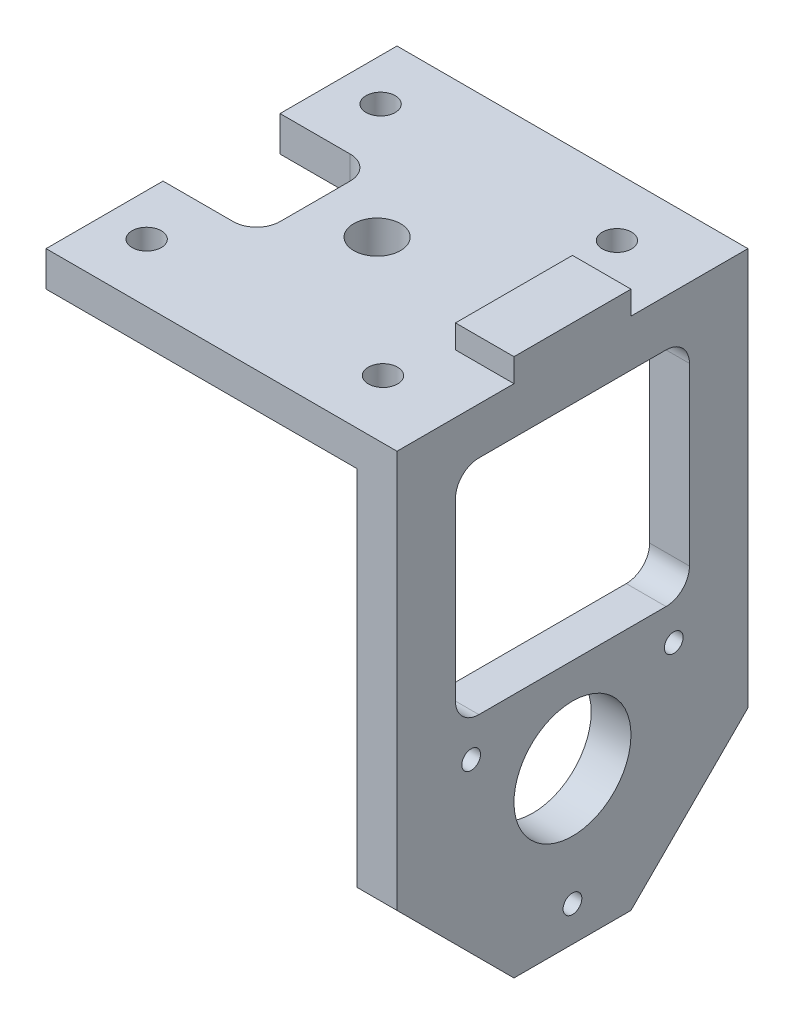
ISO-10303-21;
HEADER;
FILE_DESCRIPTION(('STEP AP214'),'2;1');
FILE_NAME('part.step','',(''),(''),'','','');
FILE_SCHEMA(('AUTOMOTIVE_DESIGN { 1 0 10303 214 1 1 1 1 }'));
ENDSEC;
DATA;
#1=APPLICATION_CONTEXT('core data for automotive mechanical design processes');
#2=APPLICATION_PROTOCOL_DEFINITION('international standard','automotive_design',2000,#1);
#3=PRODUCT_CONTEXT('',#1,'mechanical');
#4=PRODUCT('Part','Part','',(#3));
#5=PRODUCT_RELATED_PRODUCT_CATEGORY('part','',(#4));
#6=PRODUCT_DEFINITION_FORMATION('','',#4);
#7=PRODUCT_DEFINITION_CONTEXT('part definition',#1,'design');
#8=PRODUCT_DEFINITION('design','',#6,#7);
#9=PRODUCT_DEFINITION_SHAPE('','',#8);
#10=(LENGTH_UNIT() NAMED_UNIT(*) SI_UNIT(.MILLI.,.METRE.));
#11=(NAMED_UNIT(*) PLANE_ANGLE_UNIT() SI_UNIT($,.RADIAN.));
#12=(NAMED_UNIT(*) SI_UNIT($,.STERADIAN.) SOLID_ANGLE_UNIT());
#13=UNCERTAINTY_MEASURE_WITH_UNIT(LENGTH_MEASURE(1.E-05),#10,'distance_accuracy_value','');
#14=(GEOMETRIC_REPRESENTATION_CONTEXT(3) GLOBAL_UNCERTAINTY_ASSIGNED_CONTEXT((#13)) GLOBAL_UNIT_ASSIGNED_CONTEXT((#10,
#11,#12)) REPRESENTATION_CONTEXT('',''));
#15=CARTESIAN_POINT('',(0.,0.,0.));
#16=DIRECTION('',(0.,0.,1.));
#17=DIRECTION('',(1.,0.,0.));
#18=AXIS2_PLACEMENT_3D('',#15,#16,#17);
#19=CARTESIAN_POINT('',(0.,0.,-30.));
#20=DIRECTION('',(-1.,0.,0.));
#21=DIRECTION('',(0.,0.,1.));
#22=AXIS2_PLACEMENT_3D('',#19,#20,#21);
#23=PLANE('',#22);
#24=DIRECTION('',(0.,1.,0.));
#25=VECTOR('',#24,1.);
#26=CARTESIAN_POINT('',(0.,-42.001,-20.));
#27=LINE('',#26,#25);
#28=CARTESIAN_POINT('',(0.,0.,-20.));
#29=VERTEX_POINT('',#28);
#30=CARTESIAN_POINT('',(0.,3.,-20.));
#31=VERTEX_POINT('',#30);
#32=EDGE_CURVE('E227',#29,#31,#27,.T.);
#33=ORIENTED_EDGE('',*,*,#32,.T.);
#34=DIRECTION('',(0.,0.,1.));
#35=VECTOR('',#34,1.);
#36=CARTESIAN_POINT('',(0.,3.,-30.));
#37=LINE('',#36,#35);
#38=CARTESIAN_POINT('',(0.,3.,-30.));
#39=VERTEX_POINT('',#38);
#40=EDGE_CURVE('E250',#39,#31,#37,.T.);
#41=ORIENTED_EDGE('',*,*,#40,.F.);
#42=DIRECTION('',(0.,-1.,0.));
#43=VECTOR('',#42,1.);
#44=CARTESIAN_POINT('',(0.,0.,-30.));
#45=LINE('',#44,#43);
#46=CARTESIAN_POINT('',(0.,0.,-30.));
#47=VERTEX_POINT('',#46);
#48=EDGE_CURVE('E238',#39,#47,#45,.T.);
#49=ORIENTED_EDGE('',*,*,#48,.T.);
#50=DIRECTION('',(0.,0.,1.));
#51=VECTOR('',#50,1.);
#52=CARTESIAN_POINT('',(0.,0.,-30.));
#53=LINE('',#52,#51);
#54=EDGE_CURVE('E216',#47,#29,#53,.T.);
#55=ORIENTED_EDGE('',*,*,#54,.T.);
#56=EDGE_LOOP('',(#33,#41,#49,#55));
#57=FACE_BOUND('',#56,.T.);
#58=ADVANCED_FACE('F36',(#57),#23,.T.);
#59=DIRECTION('',(0.,1.,0.));
#60=VECTOR('',#59,1.);
#61=CARTESIAN_POINT('',(0.,-42.001,-10.));
#62=LINE('',#61,#60);
#63=CARTESIAN_POINT('',(0.,0.,-9.99999999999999));
#64=VERTEX_POINT('',#63);
#65=CARTESIAN_POINT('',(0.,3.,-10.));
#66=VERTEX_POINT('',#65);
#67=EDGE_CURVE('E234',#64,#66,#62,.T.);
#68=ORIENTED_EDGE('',*,*,#67,.F.);
#69=CARTESIAN_POINT('',(0.,0.,0.));
#70=VERTEX_POINT('',#69);
#71=EDGE_CURVE('E240',#64,#70,#53,.T.);
#72=ORIENTED_EDGE('',*,*,#71,.T.);
#73=DIRECTION('',(0.,-1.,0.));
#74=VECTOR('',#73,1.);
#75=CARTESIAN_POINT('',(0.,0.,0.));
#76=LINE('',#75,#74);
#77=CARTESIAN_POINT('',(0.,3.,0.));
#78=VERTEX_POINT('',#77);
#79=EDGE_CURVE('E305',#78,#70,#76,.T.);
#80=ORIENTED_EDGE('',*,*,#79,.F.);
#81=EDGE_CURVE('E288',#66,#78,#37,.T.);
#82=ORIENTED_EDGE('',*,*,#81,.F.);
#83=EDGE_LOOP('',(#68,#72,#80,#82));
#84=FACE_BOUND('',#83,.T.);
#85=ADVANCED_FACE('F515',(#84),#23,.T.);
#86=CARTESIAN_POINT('',(0.,3.,-30.));
#87=DIRECTION('',(0.,1.,0.));
#88=DIRECTION('',(0.,0.,1.));
#89=AXIS2_PLACEMENT_3D('',#86,#87,#88);
#90=PLANE('',#89);
#91=CARTESIAN_POINT('',(13.3,3.,-15.));
#92=DIRECTION('',(0.,1.,0.));
#93=DIRECTION('',(0.,0.,1.));
#94=AXIS2_PLACEMENT_3D('',#91,#92,#93);
#95=CIRCLE('',#94,2.);
#96=CARTESIAN_POINT('',(13.3,3.,-13.));
#97=VERTEX_POINT('',#96);
#98=EDGE_CURVE('E445',#97,#97,#95,.T.);
#99=ORIENTED_EDGE('',*,*,#98,.F.);
#100=EDGE_LOOP('',(#99));
#101=FACE_BOUND('',#100,.T.);
#102=CARTESIAN_POINT('',(23.8,3.,-5.));
#103=DIRECTION('',(0.,1.,0.));
#104=DIRECTION('',(0.,0.,1.));
#105=AXIS2_PLACEMENT_3D('',#102,#103,#104);
#106=CIRCLE('',#105,1.24999999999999);
#107=CARTESIAN_POINT('',(23.8,3.,-3.75000000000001));
#108=VERTEX_POINT('',#107);
#109=EDGE_CURVE('E442',#108,#108,#106,.T.);
#110=ORIENTED_EDGE('',*,*,#109,.F.);
#111=EDGE_LOOP('',(#110));
#112=FACE_BOUND('',#111,.T.);
#113=CARTESIAN_POINT('',(3.6,3.,-5.));
#114=DIRECTION('',(0.,1.,0.));
#115=DIRECTION('',(0.,0.,1.));
#116=AXIS2_PLACEMENT_3D('',#113,#114,#115);
#117=CIRCLE('',#116,1.24999999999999);
#118=CARTESIAN_POINT('',(3.6,3.,-3.75000000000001));
#119=VERTEX_POINT('',#118);
#120=EDGE_CURVE('E453',#119,#119,#117,.T.);
#121=ORIENTED_EDGE('',*,*,#120,.F.);
#122=EDGE_LOOP('',(#121));
#123=FACE_BOUND('',#122,.T.);
#124=CARTESIAN_POINT('',(23.8,3.,-25.));
#125=DIRECTION('',(0.,1.,0.));
#126=DIRECTION('',(0.,0.,1.));
#127=AXIS2_PLACEMENT_3D('',#124,#125,#126);
#128=CIRCLE('',#127,1.24999999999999);
#129=CARTESIAN_POINT('',(23.8,3.,-23.75));
#130=VERTEX_POINT('',#129);
#131=EDGE_CURVE('E459',#130,#130,#128,.T.);
#132=ORIENTED_EDGE('',*,*,#131,.F.);
#133=EDGE_LOOP('',(#132));
#134=FACE_BOUND('',#133,.T.);
#135=CARTESIAN_POINT('',(3.6,3.,-25.));
#136=DIRECTION('',(0.,1.,0.));
#137=DIRECTION('',(0.,0.,1.));
#138=AXIS2_PLACEMENT_3D('',#135,#136,#137);
#139=CIRCLE('',#138,1.24999999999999);
#140=CARTESIAN_POINT('',(3.6,3.,-23.75));
#141=VERTEX_POINT('',#140);
#142=EDGE_CURVE('E465',#141,#141,#139,.T.);
#143=ORIENTED_EDGE('',*,*,#142,.F.);
#144=EDGE_LOOP('',(#143));
#145=FACE_BOUND('',#144,.T.);
#146=DIRECTION('',(-1.,0.,0.));
#147=VECTOR('',#146,1.);
#148=CARTESIAN_POINT('',(0.,3.,-20.));
#149=LINE('',#148,#147);
#150=CARTESIAN_POINT('',(6.,3.,-20.));
#151=VERTEX_POINT('',#150);
#152=EDGE_CURVE('E230',#151,#31,#149,.T.);
#153=ORIENTED_EDGE('',*,*,#152,.F.);
#154=CARTESIAN_POINT('',(6.,3.,-18.));
#155=DIRECTION('',(0.,1.,0.));
#156=DIRECTION('',(0.,0.,1.));
#157=AXIS2_PLACEMENT_3D('',#154,#155,#156);
#158=CIRCLE('',#157,2.);
#159=CARTESIAN_POINT('',(8.,3.,-18.));
#160=VERTEX_POINT('',#159);
#161=EDGE_CURVE('E398',#151,#160,#158,.F.);
#162=ORIENTED_EDGE('',*,*,#161,.T.);
#163=DIRECTION('',(0.,0.,-1.));
#164=VECTOR('',#163,1.);
#165=CARTESIAN_POINT('',(8.,3.,-20.));
#166=LINE('',#165,#164);
#167=CARTESIAN_POINT('',(8.,3.,-12.));
#168=VERTEX_POINT('',#167);
#169=EDGE_CURVE('E474',#168,#160,#166,.T.);
#170=ORIENTED_EDGE('',*,*,#169,.F.);
#171=CARTESIAN_POINT('',(6.,3.,-12.));
#172=DIRECTION('',(0.,1.,0.));
#173=DIRECTION('',(0.,0.,1.));
#174=AXIS2_PLACEMENT_3D('',#171,#172,#173);
#175=CIRCLE('',#174,2.);
#176=CARTESIAN_POINT('',(6.,3.,-10.));
#177=VERTEX_POINT('',#176);
#178=EDGE_CURVE('E401',#168,#177,#175,.F.);
#179=ORIENTED_EDGE('',*,*,#178,.T.);
#180=DIRECTION('',(1.,0.,0.));
#181=VECTOR('',#180,1.);
#182=CARTESIAN_POINT('',(0.,3.,-10.));
#183=LINE('',#182,#181);
#184=EDGE_CURVE('E223',#66,#177,#183,.T.);
#185=ORIENTED_EDGE('',*,*,#184,.F.);
#186=ORIENTED_EDGE('',*,*,#81,.T.);
#187=DIRECTION('',(-1.,0.,0.));
#188=VECTOR('',#187,1.);
#189=CARTESIAN_POINT('',(0.,3.,0.));
#190=LINE('',#189,#188);
#191=CARTESIAN_POINT('',(30.,3.,0.));
#192=VERTEX_POINT('',#191);
#193=EDGE_CURVE('E294',#192,#78,#190,.T.);
#194=ORIENTED_EDGE('',*,*,#193,.F.);
#195=DIRECTION('',(0.,0.,1.));
#196=VECTOR('',#195,1.);
#197=CARTESIAN_POINT('',(30.,3.,-30.));
#198=LINE('',#197,#196);
#199=CARTESIAN_POINT('',(30.,3.,-9.99999999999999));
#200=VERTEX_POINT('',#199);
#201=EDGE_CURVE('E242',#200,#192,#198,.T.);
#202=ORIENTED_EDGE('',*,*,#201,.F.);
#203=DIRECTION('',(1.,0.,0.));
#204=VECTOR('',#203,1.);
#205=CARTESIAN_POINT('',(30.,3.,-10.));
#206=LINE('',#205,#204);
#207=CARTESIAN_POINT('',(25.,3.,-10.));
#208=VERTEX_POINT('',#207);
#209=EDGE_CURVE('E378',#208,#200,#206,.T.);
#210=ORIENTED_EDGE('',*,*,#209,.F.);
#211=DIRECTION('',(0.,0.,1.));
#212=VECTOR('',#211,1.);
#213=CARTESIAN_POINT('',(25.,3.,-20.));
#214=LINE('',#213,#212);
#215=CARTESIAN_POINT('',(25.,3.,-20.));
#216=VERTEX_POINT('',#215);
#217=EDGE_CURVE('E375',#216,#208,#214,.T.);
#218=ORIENTED_EDGE('',*,*,#217,.F.);
#219=DIRECTION('',(-1.,0.,0.));
#220=VECTOR('',#219,1.);
#221=CARTESIAN_POINT('',(30.,3.,-20.));
#222=LINE('',#221,#220);
#223=CARTESIAN_POINT('',(30.,3.,-20.));
#224=VERTEX_POINT('',#223);
#225=EDGE_CURVE('E481',#224,#216,#222,.T.);
#226=ORIENTED_EDGE('',*,*,#225,.F.);
#227=CARTESIAN_POINT('',(30.,3.,-30.));
#228=VERTEX_POINT('',#227);
#229=EDGE_CURVE('E285',#228,#224,#198,.T.);
#230=ORIENTED_EDGE('',*,*,#229,.F.);
#231=DIRECTION('',(-1.,0.,0.));
#232=VECTOR('',#231,1.);
#233=CARTESIAN_POINT('',(0.,3.,-30.));
#234=LINE('',#233,#232);
#235=EDGE_CURVE('E244',#228,#39,#234,.T.);
#236=ORIENTED_EDGE('',*,*,#235,.T.);
#237=ORIENTED_EDGE('',*,*,#40,.T.);
#238=EDGE_LOOP('',(#153,#162,#170,#179,#185,#186,#194,#202,#210,#218,#226,#230,#236,#237));
#239=FACE_BOUND('',#238,.T.);
#240=ADVANCED_FACE('F508',(#101,#112,#123,#134,#145,#239),#90,.T.);
#241=CARTESIAN_POINT('',(30.,3.,-30.));
#242=DIRECTION('',(1.,0.,0.));
#243=DIRECTION('',(0.,1.,0.));
#244=AXIS2_PLACEMENT_3D('',#241,#242,#243);
#245=PLANE('',#244);
#246=DIRECTION('',(0.,1.,0.));
#247=VECTOR('',#246,1.);
#248=CARTESIAN_POINT('',(30.,3.,0.));
#249=LINE('',#248,#247);
#250=CARTESIAN_POINT('',(30.,-31.,0.));
#251=VERTEX_POINT('',#250);
#252=EDGE_CURVE('E297',#251,#192,#249,.T.);
#253=ORIENTED_EDGE('',*,*,#252,.F.);
#254=DIRECTION('',(0.,0.707106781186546,0.707106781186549));
#255=VECTOR('',#254,1.);
#256=CARTESIAN_POINT('',(30.,-29.,1.99999999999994));
#257=LINE('',#256,#255);
#258=CARTESIAN_POINT('',(30.,-41.,-10.));
#259=VERTEX_POINT('',#258);
#260=EDGE_CURVE('E410',#251,#259,#257,.F.);
#261=ORIENTED_EDGE('',*,*,#260,.T.);
#262=DIRECTION('',(0.,0.,1.));
#263=VECTOR('',#262,1.);
#264=CARTESIAN_POINT('',(30.,-41.,2.36973964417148));
#265=LINE('',#264,#263);
#266=CARTESIAN_POINT('',(30.,-41.,-20.));
#267=VERTEX_POINT('',#266);
#268=EDGE_CURVE('E436',#267,#259,#265,.T.);
#269=ORIENTED_EDGE('',*,*,#268,.F.);
#270=DIRECTION('',(0.,0.707106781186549,-0.707106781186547));
#271=VECTOR('',#270,1.);
#272=CARTESIAN_POINT('',(30.,-13.9999999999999,-47.));
#273=LINE('',#272,#271);
#274=CARTESIAN_POINT('',(30.,-31.,-30.));
#275=VERTEX_POINT('',#274);
#276=EDGE_CURVE('E408',#267,#275,#273,.T.);
#277=ORIENTED_EDGE('',*,*,#276,.T.);
#278=DIRECTION('',(0.,1.,0.));
#279=VECTOR('',#278,1.);
#280=CARTESIAN_POINT('',(30.,3.,-30.));
#281=LINE('',#280,#279);
#282=EDGE_CURVE('E311',#275,#228,#281,.T.);
#283=ORIENTED_EDGE('',*,*,#282,.T.);
#284=ORIENTED_EDGE('',*,*,#229,.T.);
#285=DIRECTION('',(0.,-1.,0.));
#286=VECTOR('',#285,1.);
#287=CARTESIAN_POINT('',(30.,5.,-20.));
#288=LINE('',#287,#286);
#289=CARTESIAN_POINT('',(30.,5.,-20.));
#290=VERTEX_POINT('',#289);
#291=EDGE_CURVE('E365',#290,#224,#288,.T.);
#292=ORIENTED_EDGE('',*,*,#291,.F.);
#293=DIRECTION('',(0.,0.,-1.));
#294=VECTOR('',#293,1.);
#295=CARTESIAN_POINT('',(30.,5.,-20.));
#296=LINE('',#295,#294);
#297=CARTESIAN_POINT('',(30.,5.,-10.));
#298=VERTEX_POINT('',#297);
#299=EDGE_CURVE('E382',#298,#290,#296,.T.);
#300=ORIENTED_EDGE('',*,*,#299,.F.);
#301=DIRECTION('',(0.,-1.,0.));
#302=VECTOR('',#301,1.);
#303=CARTESIAN_POINT('',(30.,5.,-10.));
#304=LINE('',#303,#302);
#305=EDGE_CURVE('E372',#298,#200,#304,.T.);
#306=ORIENTED_EDGE('',*,*,#305,.T.);
#307=ORIENTED_EDGE('',*,*,#201,.T.);
#308=EDGE_LOOP('',(#253,#261,#269,#277,#283,#284,#292,#300,#306,#307));
#309=FACE_BOUND('',#308,.T.);
#310=CARTESIAN_POINT('',(30.,-23.0000000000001,-6.33974596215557));
#311=DIRECTION('',(1.,0.,0.));
#312=DIRECTION('',(0.,0.,-1.));
#313=AXIS2_PLACEMENT_3D('',#310,#311,#312);
#314=CIRCLE('',#313,0.799999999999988);
#315=CARTESIAN_POINT('',(30.,-23.0000000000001,-7.13974596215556));
#316=VERTEX_POINT('',#315);
#317=EDGE_CURVE('E362',#316,#316,#314,.T.);
#318=ORIENTED_EDGE('',*,*,#317,.F.);
#319=EDGE_LOOP('',(#318));
#320=FACE_BOUND('',#319,.T.);
#321=CARTESIAN_POINT('',(30.,-23.,-23.6602540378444));
#322=DIRECTION('',(1.,0.,0.));
#323=DIRECTION('',(0.,0.,-1.));
#324=AXIS2_PLACEMENT_3D('',#321,#322,#323);
#325=CIRCLE('',#324,0.799999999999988);
#326=CARTESIAN_POINT('',(30.,-23.,-24.4602540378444));
#327=VERTEX_POINT('',#326);
#328=EDGE_CURVE('E356',#327,#327,#325,.T.);
#329=ORIENTED_EDGE('',*,*,#328,.F.);
#330=EDGE_LOOP('',(#329));
#331=FACE_BOUND('',#330,.T.);
#332=CARTESIAN_POINT('',(30.,-38.,-15.));
#333=DIRECTION('',(1.,0.,0.));
#334=DIRECTION('',(0.,0.,-1.));
#335=AXIS2_PLACEMENT_3D('',#332,#333,#334);
#336=CIRCLE('',#335,0.799999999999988);
#337=CARTESIAN_POINT('',(30.,-38.,-15.8));
#338=VERTEX_POINT('',#337);
#339=EDGE_CURVE('E350',#338,#338,#336,.T.);
#340=ORIENTED_EDGE('',*,*,#339,.F.);
#341=EDGE_LOOP('',(#340));
#342=FACE_BOUND('',#341,.T.);
#343=CARTESIAN_POINT('',(30.,-28.,-15.));
#344=DIRECTION('',(1.,0.,0.));
#345=DIRECTION('',(0.,1.,0.));
#346=AXIS2_PLACEMENT_3D('',#343,#344,#345);
#347=CIRCLE('',#346,5.);
#348=CARTESIAN_POINT('',(30.,-23.,-15.));
#349=VERTEX_POINT('',#348);
#350=EDGE_CURVE('E341',#349,#349,#347,.T.);
#351=ORIENTED_EDGE('',*,*,#350,.F.);
#352=EDGE_LOOP('',(#351));
#353=FACE_BOUND('',#352,.T.);
#354=DIRECTION('',(0.,1.,0.));
#355=VECTOR('',#354,1.);
#356=CARTESIAN_POINT('',(30.,0.,-25.));
#357=LINE('',#356,#355);
#358=CARTESIAN_POINT('',(30.,-18.,-25.));
#359=VERTEX_POINT('',#358);
#360=CARTESIAN_POINT('',(30.,-3.,-25.));
#361=VERTEX_POINT('',#360);
#362=EDGE_CURVE('E329',#359,#361,#357,.T.);
#363=ORIENTED_EDGE('',*,*,#362,.F.);
#364=CARTESIAN_POINT('',(30.,-18.,-23.));
#365=DIRECTION('',(1.,0.,0.));
#366=DIRECTION('',(0.,1.,0.));
#367=AXIS2_PLACEMENT_3D('',#364,#365,#366);
#368=CIRCLE('',#367,2.);
#369=CARTESIAN_POINT('',(30.,-20.,-23.));
#370=VERTEX_POINT('',#369);
#371=EDGE_CURVE('E268',#359,#370,#368,.F.);
#372=ORIENTED_EDGE('',*,*,#371,.T.);
#373=DIRECTION('',(0.,0.,-1.));
#374=VECTOR('',#373,1.);
#375=CARTESIAN_POINT('',(30.,-20.,0.));
#376=LINE('',#375,#374);
#377=CARTESIAN_POINT('',(30.,-20.,-7.));
#378=VERTEX_POINT('',#377);
#379=EDGE_CURVE('E320',#378,#370,#376,.T.);
#380=ORIENTED_EDGE('',*,*,#379,.F.);
#381=CARTESIAN_POINT('',(30.,-18.,-7.));
#382=DIRECTION('',(1.,0.,0.));
#383=DIRECTION('',(0.,1.,0.));
#384=AXIS2_PLACEMENT_3D('',#381,#382,#383);
#385=CIRCLE('',#384,2.);
#386=CARTESIAN_POINT('',(30.,-18.,-5.));
#387=VERTEX_POINT('',#386);
#388=EDGE_CURVE('E272',#378,#387,#385,.F.);
#389=ORIENTED_EDGE('',*,*,#388,.T.);
#390=DIRECTION('',(0.,1.,0.));
#391=VECTOR('',#390,1.);
#392=CARTESIAN_POINT('',(30.,0.,-5.));
#393=LINE('',#392,#391);
#394=CARTESIAN_POINT('',(30.,-3.,-5.));
#395=VERTEX_POINT('',#394);
#396=EDGE_CURVE('E323',#387,#395,#393,.T.);
#397=ORIENTED_EDGE('',*,*,#396,.T.);
#398=CARTESIAN_POINT('',(30.,-3.,-7.));
#399=DIRECTION('',(1.,0.,0.));
#400=DIRECTION('',(0.,1.,0.));
#401=AXIS2_PLACEMENT_3D('',#398,#399,#400);
#402=CIRCLE('',#401,2.);
#403=CARTESIAN_POINT('',(30.,-1.,-7.));
#404=VERTEX_POINT('',#403);
#405=EDGE_CURVE('E276',#395,#404,#402,.F.);
#406=ORIENTED_EDGE('',*,*,#405,.T.);
#407=DIRECTION('',(0.,0.,1.));
#408=VECTOR('',#407,1.);
#409=CARTESIAN_POINT('',(30.,-1.,0.));
#410=LINE('',#409,#408);
#411=CARTESIAN_POINT('',(30.,-0.999999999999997,-23.));
#412=VERTEX_POINT('',#411);
#413=EDGE_CURVE('E326',#412,#404,#410,.T.);
#414=ORIENTED_EDGE('',*,*,#413,.F.);
#415=CARTESIAN_POINT('',(30.,-3.,-23.));
#416=DIRECTION('',(1.,0.,0.));
#417=DIRECTION('',(0.,1.,0.));
#418=AXIS2_PLACEMENT_3D('',#415,#416,#417);
#419=CIRCLE('',#418,2.);
#420=EDGE_CURVE('E280',#412,#361,#419,.F.);
#421=ORIENTED_EDGE('',*,*,#420,.T.);
#422=EDGE_LOOP('',(#363,#372,#380,#389,#397,#406,#414,#421));
#423=FACE_BOUND('',#422,.T.);
#424=ADVANCED_FACE('F434',(#309,#320,#331,#342,#353,#423),#245,.T.);
#425=CARTESIAN_POINT('',(26.6,0.,-30.));
#426=DIRECTION('',(-1.,0.,0.));
#427=DIRECTION('',(0.,-1.,0.));
#428=AXIS2_PLACEMENT_3D('',#425,#426,#427);
#429=PLANE('',#428);
#430=DIRECTION('',(0.,0.,-1.));
#431=VECTOR('',#430,1.);
#432=CARTESIAN_POINT('',(26.6,-41.,-30.));
#433=LINE('',#432,#431);
#434=CARTESIAN_POINT('',(26.6,-41.,-10.0000000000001));
#435=VERTEX_POINT('',#434);
#436=CARTESIAN_POINT('',(26.6,-41.,-20.));
#437=VERTEX_POINT('',#436);
#438=EDGE_CURVE('E422',#435,#437,#433,.T.);
#439=ORIENTED_EDGE('',*,*,#438,.F.);
#440=DIRECTION('',(0.,-0.707106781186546,-0.707106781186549));
#441=VECTOR('',#440,1.);
#442=CARTESIAN_POINT('',(26.6,-30.5,0.499999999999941));
#443=LINE('',#442,#441);
#444=CARTESIAN_POINT('',(26.6,-31.,0.));
#445=VERTEX_POINT('',#444);
#446=EDGE_CURVE('E45',#435,#445,#443,.F.);
#447=ORIENTED_EDGE('',*,*,#446,.T.);
#448=DIRECTION('',(0.,-1.,0.));
#449=VECTOR('',#448,1.);
#450=CARTESIAN_POINT('',(26.6,0.,0.));
#451=LINE('',#450,#449);
#452=CARTESIAN_POINT('',(26.6,0.,0.));
#453=VERTEX_POINT('',#452);
#454=EDGE_CURVE('E299',#453,#445,#451,.T.);
#455=ORIENTED_EDGE('',*,*,#454,.F.);
#456=DIRECTION('',(0.,0.,1.));
#457=VECTOR('',#456,1.);
#458=CARTESIAN_POINT('',(26.6,0.,-30.));
#459=LINE('',#458,#457);
#460=CARTESIAN_POINT('',(26.6,0.,-30.));
#461=VERTEX_POINT('',#460);
#462=EDGE_CURVE('E239',#461,#453,#459,.T.);
#463=ORIENTED_EDGE('',*,*,#462,.F.);
#464=DIRECTION('',(0.,-1.,0.));
#465=VECTOR('',#464,1.);
#466=CARTESIAN_POINT('',(26.6,0.,-30.));
#467=LINE('',#466,#465);
#468=CARTESIAN_POINT('',(26.6,-31.,-30.));
#469=VERTEX_POINT('',#468);
#470=EDGE_CURVE('E313',#461,#469,#467,.T.);
#471=ORIENTED_EDGE('',*,*,#470,.T.);
#472=DIRECTION('',(0.,-0.707106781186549,0.707106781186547));
#473=VECTOR('',#472,1.);
#474=CARTESIAN_POINT('',(26.6,-15.4999999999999,-45.5));
#475=LINE('',#474,#473);
#476=EDGE_CURVE('E57',#469,#437,#475,.T.);
#477=ORIENTED_EDGE('',*,*,#476,.T.);
#478=EDGE_LOOP('',(#439,#447,#455,#463,#471,#477));
#479=FACE_BOUND('',#478,.T.);
#480=CARTESIAN_POINT('',(26.6,-23.0000000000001,-6.33974596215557));
#481=DIRECTION('',(-1.,0.,0.));
#482=DIRECTION('',(0.,-1.,0.));
#483=AXIS2_PLACEMENT_3D('',#480,#481,#482);
#484=CIRCLE('',#483,0.799999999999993);
#485=CARTESIAN_POINT('',(26.6,-23.8000000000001,-6.33974596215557));
#486=VERTEX_POINT('',#485);
#487=EDGE_CURVE('E359',#486,#486,#484,.T.);
#488=ORIENTED_EDGE('',*,*,#487,.F.);
#489=EDGE_LOOP('',(#488));
#490=FACE_BOUND('',#489,.T.);
#491=CARTESIAN_POINT('',(26.6,-23.,-23.6602540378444));
#492=DIRECTION('',(-1.,0.,0.));
#493=DIRECTION('',(0.,-1.,0.));
#494=AXIS2_PLACEMENT_3D('',#491,#492,#493);
#495=CIRCLE('',#494,0.799999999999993);
#496=CARTESIAN_POINT('',(26.6,-23.8,-23.6602540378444));
#497=VERTEX_POINT('',#496);
#498=EDGE_CURVE('E353',#497,#497,#495,.T.);
#499=ORIENTED_EDGE('',*,*,#498,.F.);
#500=EDGE_LOOP('',(#499));
#501=FACE_BOUND('',#500,.T.);
#502=CARTESIAN_POINT('',(26.6,-38.,-15.));
#503=DIRECTION('',(-1.,0.,0.));
#504=DIRECTION('',(0.,-1.,0.));
#505=AXIS2_PLACEMENT_3D('',#502,#503,#504);
#506=CIRCLE('',#505,0.799999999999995);
#507=CARTESIAN_POINT('',(26.6,-38.8,-15.));
#508=VERTEX_POINT('',#507);
#509=EDGE_CURVE('E345',#508,#508,#506,.T.);
#510=ORIENTED_EDGE('',*,*,#509,.F.);
#511=EDGE_LOOP('',(#510));
#512=FACE_BOUND('',#511,.T.);
#513=CARTESIAN_POINT('',(26.6,-28.,-15.));
#514=DIRECTION('',(-1.,0.,0.));
#515=DIRECTION('',(0.,-1.,0.));
#516=AXIS2_PLACEMENT_3D('',#513,#514,#515);
#517=CIRCLE('',#516,5.);
#518=CARTESIAN_POINT('',(26.6,-33.,-15.));
#519=VERTEX_POINT('',#518);
#520=EDGE_CURVE('E342',#519,#519,#517,.F.);
#521=ORIENTED_EDGE('',*,*,#520,.T.);
#522=EDGE_LOOP('',(#521));
#523=FACE_BOUND('',#522,.T.);
#524=DIRECTION('',(0.,0.,-1.));
#525=VECTOR('',#524,1.);
#526=CARTESIAN_POINT('',(26.6,-20.,0.));
#527=LINE('',#526,#525);
#528=CARTESIAN_POINT('',(26.6,-20.,-7.));
#529=VERTEX_POINT('',#528);
#530=CARTESIAN_POINT('',(26.6,-20.,-23.));
#531=VERTEX_POINT('',#530);
#532=EDGE_CURVE('E335',#529,#531,#527,.T.);
#533=ORIENTED_EDGE('',*,*,#532,.T.);
#534=CARTESIAN_POINT('',(26.6,-18.,-23.));
#535=DIRECTION('',(-1.,0.,0.));
#536=DIRECTION('',(0.,-1.,0.));
#537=AXIS2_PLACEMENT_3D('',#534,#535,#536);
#538=CIRCLE('',#537,2.);
#539=CARTESIAN_POINT('',(26.6,-18.,-25.));
#540=VERTEX_POINT('',#539);
#541=EDGE_CURVE('E270',#531,#540,#538,.F.);
#542=ORIENTED_EDGE('',*,*,#541,.T.);
#543=DIRECTION('',(0.,1.,0.));
#544=VECTOR('',#543,1.);
#545=CARTESIAN_POINT('',(26.6,0.,-25.));
#546=LINE('',#545,#544);
#547=CARTESIAN_POINT('',(26.6,-3.,-25.));
#548=VERTEX_POINT('',#547);
#549=EDGE_CURVE('E332',#540,#548,#546,.T.);
#550=ORIENTED_EDGE('',*,*,#549,.T.);
#551=CARTESIAN_POINT('',(26.6,-3.,-23.));
#552=DIRECTION('',(-1.,0.,0.));
#553=DIRECTION('',(0.,-1.,0.));
#554=AXIS2_PLACEMENT_3D('',#551,#552,#553);
#555=CIRCLE('',#554,2.);
#556=CARTESIAN_POINT('',(26.6,-0.999999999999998,-23.));
#557=VERTEX_POINT('',#556);
#558=EDGE_CURVE('E282',#548,#557,#555,.F.);
#559=ORIENTED_EDGE('',*,*,#558,.T.);
#560=DIRECTION('',(0.,0.,1.));
#561=VECTOR('',#560,1.);
#562=CARTESIAN_POINT('',(26.6,-1.,0.));
#563=LINE('',#562,#561);
#564=CARTESIAN_POINT('',(26.6,-1.,-7.));
#565=VERTEX_POINT('',#564);
#566=EDGE_CURVE('E308',#557,#565,#563,.T.);
#567=ORIENTED_EDGE('',*,*,#566,.T.);
#568=CARTESIAN_POINT('',(26.6,-3.,-7.));
#569=DIRECTION('',(-1.,0.,0.));
#570=DIRECTION('',(0.,-1.,0.));
#571=AXIS2_PLACEMENT_3D('',#568,#569,#570);
#572=CIRCLE('',#571,2.);
#573=CARTESIAN_POINT('',(26.6,-3.,-5.));
#574=VERTEX_POINT('',#573);
#575=EDGE_CURVE('E278',#565,#574,#572,.F.);
#576=ORIENTED_EDGE('',*,*,#575,.T.);
#577=DIRECTION('',(0.,1.,0.));
#578=VECTOR('',#577,1.);
#579=CARTESIAN_POINT('',(26.6,0.,-5.));
#580=LINE('',#579,#578);
#581=CARTESIAN_POINT('',(26.6,-18.,-5.));
#582=VERTEX_POINT('',#581);
#583=EDGE_CURVE('E338',#582,#574,#580,.T.);
#584=ORIENTED_EDGE('',*,*,#583,.F.);
#585=CARTESIAN_POINT('',(26.6,-18.,-7.));
#586=DIRECTION('',(-1.,0.,0.));
#587=DIRECTION('',(0.,-1.,0.));
#588=AXIS2_PLACEMENT_3D('',#585,#586,#587);
#589=CIRCLE('',#588,2.);
#590=EDGE_CURVE('E274',#582,#529,#589,.F.);
#591=ORIENTED_EDGE('',*,*,#590,.T.);
#592=EDGE_LOOP('',(#533,#542,#550,#559,#567,#576,#584,#591));
#593=FACE_BOUND('',#592,.T.);
#594=ADVANCED_FACE('F420',(#479,#490,#501,#512,#523,#593),#429,.T.);
#595=CARTESIAN_POINT('',(0.,0.,-30.));
#596=DIRECTION('',(0.,-1.,0.));
#597=DIRECTION('',(0.,0.,-1.));
#598=AXIS2_PLACEMENT_3D('',#595,#596,#597);
#599=PLANE('',#598);
#600=CARTESIAN_POINT('',(13.3,0.,-15.));
#601=DIRECTION('',(0.,-1.,0.));
#602=DIRECTION('',(0.,0.,-1.));
#603=AXIS2_PLACEMENT_3D('',#600,#601,#602);
#604=CIRCLE('',#603,2.);
#605=CARTESIAN_POINT('',(13.3,0.,-17.));
#606=VERTEX_POINT('',#605);
#607=EDGE_CURVE('E40',#606,#606,#604,.T.);
#608=ORIENTED_EDGE('',*,*,#607,.F.);
#609=EDGE_LOOP('',(#608));
#610=FACE_BOUND('',#609,.T.);
#611=CARTESIAN_POINT('',(23.8,0.,-5.));
#612=DIRECTION('',(0.,-1.,0.));
#613=DIRECTION('',(0.,0.,-1.));
#614=AXIS2_PLACEMENT_3D('',#611,#612,#613);
#615=CIRCLE('',#614,1.24999999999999);
#616=CARTESIAN_POINT('',(23.8,0.,-6.24999999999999));
#617=VERTEX_POINT('',#616);
#618=EDGE_CURVE('E450',#617,#617,#615,.T.);
#619=ORIENTED_EDGE('',*,*,#618,.F.);
#620=EDGE_LOOP('',(#619));
#621=FACE_BOUND('',#620,.T.);
#622=CARTESIAN_POINT('',(3.6,0.,-5.));
#623=DIRECTION('',(0.,-1.,0.));
#624=DIRECTION('',(0.,0.,-1.));
#625=AXIS2_PLACEMENT_3D('',#622,#623,#624);
#626=CIRCLE('',#625,1.24999999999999);
#627=CARTESIAN_POINT('',(3.6,0.,-6.24999999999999));
#628=VERTEX_POINT('',#627);
#629=EDGE_CURVE('E456',#628,#628,#626,.T.);
#630=ORIENTED_EDGE('',*,*,#629,.F.);
#631=EDGE_LOOP('',(#630));
#632=FACE_BOUND('',#631,.T.);
#633=CARTESIAN_POINT('',(23.8,0.,-25.));
#634=DIRECTION('',(0.,-1.,0.));
#635=DIRECTION('',(0.,0.,-1.));
#636=AXIS2_PLACEMENT_3D('',#633,#634,#635);
#637=CIRCLE('',#636,1.24999999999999);
#638=CARTESIAN_POINT('',(23.8,0.,-26.25));
#639=VERTEX_POINT('',#638);
#640=EDGE_CURVE('E462',#639,#639,#637,.T.);
#641=ORIENTED_EDGE('',*,*,#640,.F.);
#642=EDGE_LOOP('',(#641));
#643=FACE_BOUND('',#642,.T.);
#644=CARTESIAN_POINT('',(3.6,0.,-25.));
#645=DIRECTION('',(0.,-1.,0.));
#646=DIRECTION('',(0.,0.,-1.));
#647=AXIS2_PLACEMENT_3D('',#644,#645,#646);
#648=CIRCLE('',#647,1.24999999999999);
#649=CARTESIAN_POINT('',(3.6,0.,-26.25));
#650=VERTEX_POINT('',#649);
#651=EDGE_CURVE('E468',#650,#650,#648,.T.);
#652=ORIENTED_EDGE('',*,*,#651,.F.);
#653=EDGE_LOOP('',(#652));
#654=FACE_BOUND('',#653,.T.);
#655=DIRECTION('',(0.,0.,-1.));
#656=VECTOR('',#655,1.);
#657=CARTESIAN_POINT('',(8.,0.,-20.));
#658=LINE('',#657,#656);
#659=CARTESIAN_POINT('',(8.,0.,-12.));
#660=VERTEX_POINT('',#659);
#661=CARTESIAN_POINT('',(8.,0.,-18.));
#662=VERTEX_POINT('',#661);
#663=EDGE_CURVE('E224',#660,#662,#658,.T.);
#664=ORIENTED_EDGE('',*,*,#663,.T.);
#665=CARTESIAN_POINT('',(6.,0.,-18.));
#666=DIRECTION('',(0.,-1.,0.));
#667=DIRECTION('',(0.,0.,-1.));
#668=AXIS2_PLACEMENT_3D('',#665,#666,#667);
#669=CIRCLE('',#668,2.);
#670=CARTESIAN_POINT('',(6.,0.,-20.));
#671=VERTEX_POINT('',#670);
#672=EDGE_CURVE('E219',#662,#671,#669,.F.);
#673=ORIENTED_EDGE('',*,*,#672,.T.);
#674=DIRECTION('',(-1.,0.,0.));
#675=VECTOR('',#674,1.);
#676=CARTESIAN_POINT('',(0.,0.,-20.));
#677=LINE('',#676,#675);
#678=EDGE_CURVE('E210',#671,#29,#677,.T.);
#679=ORIENTED_EDGE('',*,*,#678,.T.);
#680=ORIENTED_EDGE('',*,*,#54,.F.);
#681=DIRECTION('',(1.,0.,0.));
#682=VECTOR('',#681,1.);
#683=CARTESIAN_POINT('',(0.,0.,-30.));
#684=LINE('',#683,#682);
#685=EDGE_CURVE('E315',#47,#461,#684,.T.);
#686=ORIENTED_EDGE('',*,*,#685,.T.);
#687=ORIENTED_EDGE('',*,*,#462,.T.);
#688=DIRECTION('',(1.,0.,0.));
#689=VECTOR('',#688,1.);
#690=CARTESIAN_POINT('',(0.,0.,0.));
#691=LINE('',#690,#689);
#692=EDGE_CURVE('E302',#70,#453,#691,.T.);
#693=ORIENTED_EDGE('',*,*,#692,.F.);
#694=ORIENTED_EDGE('',*,*,#71,.F.);
#695=DIRECTION('',(1.,0.,0.));
#696=VECTOR('',#695,1.);
#697=CARTESIAN_POINT('',(0.,0.,-10.));
#698=LINE('',#697,#696);
#699=CARTESIAN_POINT('',(6.,0.,-10.));
#700=VERTEX_POINT('',#699);
#701=EDGE_CURVE('E233',#64,#700,#698,.T.);
#702=ORIENTED_EDGE('',*,*,#701,.T.);
#703=CARTESIAN_POINT('',(6.,0.,-12.));
#704=DIRECTION('',(0.,-1.,0.));
#705=DIRECTION('',(0.,0.,-1.));
#706=AXIS2_PLACEMENT_3D('',#703,#704,#705);
#707=CIRCLE('',#706,2.);
#708=EDGE_CURVE('E403',#700,#660,#707,.F.);
#709=ORIENTED_EDGE('',*,*,#708,.T.);
#710=EDGE_LOOP('',(#664,#673,#679,#680,#686,#687,#693,#694,#702,#709));
#711=FACE_BOUND('',#710,.T.);
#712=ADVANCED_FACE('F213',(#610,#621,#632,#643,#654,#711),#599,.T.);
#713=CARTESIAN_POINT('',(0.,0.,-30.));
#714=DIRECTION('',(0.,0.,-1.));
#715=DIRECTION('',(-1.,0.,0.));
#716=AXIS2_PLACEMENT_3D('',#713,#714,#715);
#717=PLANE('',#716);
#718=ORIENTED_EDGE('',*,*,#282,.F.);
#719=DIRECTION('',(-1.,0.,0.));
#720=VECTOR('',#719,1.);
#721=CARTESIAN_POINT('',(26.6,-31.,-30.));
#722=LINE('',#721,#720);
#723=EDGE_CURVE('E11',#275,#469,#722,.T.);
#724=ORIENTED_EDGE('',*,*,#723,.T.);
#725=ORIENTED_EDGE('',*,*,#470,.F.);
#726=ORIENTED_EDGE('',*,*,#685,.F.);
#727=ORIENTED_EDGE('',*,*,#48,.F.);
#728=ORIENTED_EDGE('',*,*,#235,.F.);
#729=EDGE_LOOP('',(#718,#724,#725,#726,#727,#728));
#730=FACE_BOUND('',#729,.T.);
#731=ADVANCED_FACE('F517',(#730),#717,.T.);
#732=CARTESIAN_POINT('',(0.,0.,0.));
#733=DIRECTION('',(0.,0.,-1.));
#734=DIRECTION('',(-1.,0.,0.));
#735=AXIS2_PLACEMENT_3D('',#732,#733,#734);
#736=PLANE('',#735);
#737=ORIENTED_EDGE('',*,*,#454,.T.);
#738=DIRECTION('',(1.,0.,0.));
#739=VECTOR('',#738,1.);
#740=CARTESIAN_POINT('',(0.,-31.,0.));
#741=LINE('',#740,#739);
#742=EDGE_CURVE('E405',#445,#251,#741,.T.);
#743=ORIENTED_EDGE('',*,*,#742,.T.);
#744=ORIENTED_EDGE('',*,*,#252,.T.);
#745=ORIENTED_EDGE('',*,*,#193,.T.);
#746=ORIENTED_EDGE('',*,*,#79,.T.);
#747=ORIENTED_EDGE('',*,*,#692,.T.);
#748=EDGE_LOOP('',(#737,#743,#744,#745,#746,#747));
#749=FACE_BOUND('',#748,.T.);
#750=ADVANCED_FACE('F427',(#749),#736,.F.);
#751=CARTESIAN_POINT('',(-0.00100000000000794,0.,-25.));
#752=DIRECTION('',(0.,0.,-1.));
#753=DIRECTION('',(-1.,0.,0.));
#754=AXIS2_PLACEMENT_3D('',#751,#752,#753);
#755=PLANE('',#754);
#756=ORIENTED_EDGE('',*,*,#549,.F.);
#757=DIRECTION('',(1.,0.,0.));
#758=VECTOR('',#757,1.);
#759=CARTESIAN_POINT('',(30.,-18.,-25.));
#760=LINE('',#759,#758);
#761=EDGE_CURVE('E249',#540,#359,#760,.T.);
#762=ORIENTED_EDGE('',*,*,#761,.T.);
#763=ORIENTED_EDGE('',*,*,#362,.T.);
#764=DIRECTION('',(1.,0.,0.));
#765=VECTOR('',#764,1.);
#766=CARTESIAN_POINT('',(26.6,-3.,-25.));
#767=LINE('',#766,#765);
#768=EDGE_CURVE('E247',#361,#548,#767,.F.);
#769=ORIENTED_EDGE('',*,*,#768,.T.);
#770=EDGE_LOOP('',(#756,#762,#763,#769));
#771=FACE_BOUND('',#770,.T.);
#772=ADVANCED_FACE('F596',(#771),#755,.F.);
#773=CARTESIAN_POINT('',(-0.00100000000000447,-20.,0.));
#774=DIRECTION('',(0.,-1.,0.));
#775=DIRECTION('',(1.,0.,0.));
#776=AXIS2_PLACEMENT_3D('',#773,#774,#775);
#777=PLANE('',#776);
#778=ORIENTED_EDGE('',*,*,#379,.T.);
#779=DIRECTION('',(1.,0.,0.));
#780=VECTOR('',#779,1.);
#781=CARTESIAN_POINT('',(26.6,-20.,-23.));
#782=LINE('',#781,#780);
#783=EDGE_CURVE('E256',#370,#531,#782,.F.);
#784=ORIENTED_EDGE('',*,*,#783,.T.);
#785=ORIENTED_EDGE('',*,*,#532,.F.);
#786=DIRECTION('',(1.,0.,0.));
#787=VECTOR('',#786,1.);
#788=CARTESIAN_POINT('',(-0.00100000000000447,-20.,-7.));
#789=LINE('',#788,#787);
#790=EDGE_CURVE('E253',#529,#378,#789,.T.);
#791=ORIENTED_EDGE('',*,*,#790,.T.);
#792=EDGE_LOOP('',(#778,#784,#785,#791));
#793=FACE_BOUND('',#792,.T.);
#794=ADVANCED_FACE('F591',(#793),#777,.F.);
#795=CARTESIAN_POINT('',(-0.00100000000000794,0.,-5.));
#796=DIRECTION('',(0.,0.,-1.));
#797=DIRECTION('',(-1.,0.,0.));
#798=AXIS2_PLACEMENT_3D('',#795,#796,#797);
#799=PLANE('',#798);
#800=ORIENTED_EDGE('',*,*,#396,.F.);
#801=DIRECTION('',(1.,0.,0.));
#802=VECTOR('',#801,1.);
#803=CARTESIAN_POINT('',(-0.00100000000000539,-18.,-5.));
#804=LINE('',#803,#802);
#805=EDGE_CURVE('E261',#387,#582,#804,.F.);
#806=ORIENTED_EDGE('',*,*,#805,.T.);
#807=ORIENTED_EDGE('',*,*,#583,.T.);
#808=DIRECTION('',(1.,0.,0.));
#809=VECTOR('',#808,1.);
#810=CARTESIAN_POINT('',(-0.00100000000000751,-3.,-5.));
#811=LINE('',#810,#809);
#812=EDGE_CURVE('E258',#574,#395,#811,.T.);
#813=ORIENTED_EDGE('',*,*,#812,.T.);
#814=EDGE_LOOP('',(#800,#806,#807,#813));
#815=FACE_BOUND('',#814,.T.);
#816=ADVANCED_FACE('F585',(#815),#799,.T.);
#817=CARTESIAN_POINT('',(-0.00100000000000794,-1.,0.));
#818=DIRECTION('',(0.,1.,0.));
#819=DIRECTION('',(-1.,0.,0.));
#820=AXIS2_PLACEMENT_3D('',#817,#818,#819);
#821=PLANE('',#820);
#822=ORIENTED_EDGE('',*,*,#413,.T.);
#823=DIRECTION('',(1.,0.,0.));
#824=VECTOR('',#823,1.);
#825=CARTESIAN_POINT('',(-0.00100000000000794,-1.,-7.));
#826=LINE('',#825,#824);
#827=EDGE_CURVE('E266',#404,#565,#826,.F.);
#828=ORIENTED_EDGE('',*,*,#827,.T.);
#829=ORIENTED_EDGE('',*,*,#566,.F.);
#830=DIRECTION('',(1.,0.,0.));
#831=VECTOR('',#830,1.);
#832=CARTESIAN_POINT('',(30.,-0.999999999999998,-23.));
#833=LINE('',#832,#831);
#834=EDGE_CURVE('E263',#557,#412,#833,.T.);
#835=ORIENTED_EDGE('',*,*,#834,.T.);
#836=EDGE_LOOP('',(#822,#828,#829,#835));
#837=FACE_BOUND('',#836,.T.);
#838=ADVANCED_FACE('F577',(#837),#821,.F.);
#839=CARTESIAN_POINT('',(-0.00100000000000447,-28.,-15.));
#840=DIRECTION('',(1.,0.,0.));
#841=DIRECTION('',(0.,1.,0.));
#842=AXIS2_PLACEMENT_3D('',#839,#840,#841);
#843=CYLINDRICAL_SURFACE('',#842,5.);
#844=ORIENTED_EDGE('',*,*,#520,.F.);
#845=EDGE_LOOP('',(#844));
#846=FACE_BOUND('',#845,.T.);
#847=ORIENTED_EDGE('',*,*,#350,.T.);
#848=EDGE_LOOP('',(#847));
#849=FACE_BOUND('',#848,.T.);
#850=ADVANCED_FACE('F616',(#846,#849),#843,.F.);
#851=CARTESIAN_POINT('',(30.,-38.,-15.));
#852=DIRECTION('',(1.,0.,0.));
#853=DIRECTION('',(0.,0.,-1.));
#854=AXIS2_PLACEMENT_3D('',#851,#852,#853);
#855=CYLINDRICAL_SURFACE('',#854,0.799999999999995);
#856=ORIENTED_EDGE('',*,*,#339,.T.);
#857=EDGE_LOOP('',(#856));
#858=FACE_BOUND('',#857,.T.);
#859=ORIENTED_EDGE('',*,*,#509,.T.);
#860=EDGE_LOOP('',(#859));
#861=FACE_BOUND('',#860,.T.);
#862=ADVANCED_FACE('F623',(#858,#861),#855,.F.);
#863=CARTESIAN_POINT('',(30.,-23.,-23.6602540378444));
#864=DIRECTION('',(1.,0.,0.));
#865=DIRECTION('',(0.,0.,-1.));
#866=AXIS2_PLACEMENT_3D('',#863,#864,#865);
#867=CYLINDRICAL_SURFACE('',#866,0.799999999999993);
#868=ORIENTED_EDGE('',*,*,#328,.T.);
#869=EDGE_LOOP('',(#868));
#870=FACE_BOUND('',#869,.T.);
#871=ORIENTED_EDGE('',*,*,#498,.T.);
#872=EDGE_LOOP('',(#871));
#873=FACE_BOUND('',#872,.T.);
#874=ADVANCED_FACE('F627',(#870,#873),#867,.F.);
#875=CARTESIAN_POINT('',(30.,-23.0000000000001,-6.33974596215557));
#876=DIRECTION('',(1.,0.,0.));
#877=DIRECTION('',(0.,0.,-1.));
#878=AXIS2_PLACEMENT_3D('',#875,#876,#877);
#879=CYLINDRICAL_SURFACE('',#878,0.799999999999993);
#880=ORIENTED_EDGE('',*,*,#317,.T.);
#881=EDGE_LOOP('',(#880));
#882=FACE_BOUND('',#881,.T.);
#883=ORIENTED_EDGE('',*,*,#487,.T.);
#884=EDGE_LOOP('',(#883));
#885=FACE_BOUND('',#884,.T.);
#886=ADVANCED_FACE('F553',(#882,#885),#879,.F.);
#887=CARTESIAN_POINT('',(-0.00100000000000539,-18.,-23.));
#888=DIRECTION('',(-1.,0.,0.));
#889=DIRECTION('',(0.,-1.,0.));
#890=AXIS2_PLACEMENT_3D('',#887,#888,#889);
#891=CYLINDRICAL_SURFACE('',#890,2.);
#892=ORIENTED_EDGE('',*,*,#541,.F.);
#893=ORIENTED_EDGE('',*,*,#783,.F.);
#894=ORIENTED_EDGE('',*,*,#371,.F.);
#895=ORIENTED_EDGE('',*,*,#761,.F.);
#896=EDGE_LOOP('',(#892,#893,#894,#895));
#897=FACE_BOUND('',#896,.T.);
#898=ADVANCED_FACE('F549',(#897),#891,.F.);
#899=CARTESIAN_POINT('',(-0.00100000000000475,-18.,-7.));
#900=DIRECTION('',(1.,0.,0.));
#901=DIRECTION('',(0.,1.,0.));
#902=AXIS2_PLACEMENT_3D('',#899,#900,#901);
#903=CYLINDRICAL_SURFACE('',#902,2.);
#904=ORIENTED_EDGE('',*,*,#590,.F.);
#905=ORIENTED_EDGE('',*,*,#805,.F.);
#906=ORIENTED_EDGE('',*,*,#388,.F.);
#907=ORIENTED_EDGE('',*,*,#790,.F.);
#908=EDGE_LOOP('',(#904,#905,#906,#907));
#909=FACE_BOUND('',#908,.T.);
#910=ADVANCED_FACE('F552',(#909),#903,.F.);
#911=CARTESIAN_POINT('',(-0.00100000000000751,-3.,-7.));
#912=DIRECTION('',(1.,0.,0.));
#913=DIRECTION('',(0.,1.,0.));
#914=AXIS2_PLACEMENT_3D('',#911,#912,#913);
#915=CYLINDRICAL_SURFACE('',#914,2.);
#916=ORIENTED_EDGE('',*,*,#575,.F.);
#917=ORIENTED_EDGE('',*,*,#827,.F.);
#918=ORIENTED_EDGE('',*,*,#405,.F.);
#919=ORIENTED_EDGE('',*,*,#812,.F.);
#920=EDGE_LOOP('',(#916,#917,#918,#919));
#921=FACE_BOUND('',#920,.T.);
#922=ADVANCED_FACE('F557',(#921),#915,.F.);
#923=CARTESIAN_POINT('',(-0.00100000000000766,-3.,-23.));
#924=DIRECTION('',(-1.,0.,0.));
#925=DIRECTION('',(0.,-1.,0.));
#926=AXIS2_PLACEMENT_3D('',#923,#924,#925);
#927=CYLINDRICAL_SURFACE('',#926,2.);
#928=ORIENTED_EDGE('',*,*,#558,.F.);
#929=ORIENTED_EDGE('',*,*,#768,.F.);
#930=ORIENTED_EDGE('',*,*,#420,.F.);
#931=ORIENTED_EDGE('',*,*,#834,.F.);
#932=EDGE_LOOP('',(#928,#929,#930,#931));
#933=FACE_BOUND('',#932,.T.);
#934=ADVANCED_FACE('F560',(#933),#927,.F.);
#935=CARTESIAN_POINT('',(30.,5.,-20.));
#936=DIRECTION('',(0.,0.,1.));
#937=DIRECTION('',(1.,0.,0.));
#938=AXIS2_PLACEMENT_3D('',#935,#936,#937);
#939=PLANE('',#938);
#940=ORIENTED_EDGE('',*,*,#225,.T.);
#941=DIRECTION('',(0.,-1.,0.));
#942=VECTOR('',#941,1.);
#943=CARTESIAN_POINT('',(25.,5.,-20.));
#944=LINE('',#943,#942);
#945=CARTESIAN_POINT('',(25.,5.,-20.));
#946=VERTEX_POINT('',#945);
#947=EDGE_CURVE('E366',#946,#216,#944,.T.);
#948=ORIENTED_EDGE('',*,*,#947,.F.);
#949=DIRECTION('',(-1.,0.,0.));
#950=VECTOR('',#949,1.);
#951=CARTESIAN_POINT('',(30.,5.,-20.));
#952=LINE('',#951,#950);
#953=EDGE_CURVE('E484',#290,#946,#952,.T.);
#954=ORIENTED_EDGE('',*,*,#953,.F.);
#955=ORIENTED_EDGE('',*,*,#291,.T.);
#956=EDGE_LOOP('',(#940,#948,#954,#955));
#957=FACE_BOUND('',#956,.T.);
#958=ADVANCED_FACE('F563',(#957),#939,.F.);
#959=CARTESIAN_POINT('',(25.,5.,-20.));
#960=DIRECTION('',(1.,0.,0.));
#961=DIRECTION('',(0.,0.,-1.));
#962=AXIS2_PLACEMENT_3D('',#959,#960,#961);
#963=PLANE('',#962);
#964=ORIENTED_EDGE('',*,*,#217,.T.);
#965=DIRECTION('',(0.,-1.,0.));
#966=VECTOR('',#965,1.);
#967=CARTESIAN_POINT('',(25.,5.,-10.));
#968=LINE('',#967,#966);
#969=CARTESIAN_POINT('',(25.,5.,-10.));
#970=VERTEX_POINT('',#969);
#971=EDGE_CURVE('E369',#970,#208,#968,.T.);
#972=ORIENTED_EDGE('',*,*,#971,.F.);
#973=DIRECTION('',(0.,0.,1.));
#974=VECTOR('',#973,1.);
#975=CARTESIAN_POINT('',(25.,5.,-20.));
#976=LINE('',#975,#974);
#977=EDGE_CURVE('E486',#946,#970,#976,.T.);
#978=ORIENTED_EDGE('',*,*,#977,.F.);
#979=ORIENTED_EDGE('',*,*,#947,.T.);
#980=EDGE_LOOP('',(#964,#972,#978,#979));
#981=FACE_BOUND('',#980,.T.);
#982=ADVANCED_FACE('F506',(#981),#963,.F.);
#983=CARTESIAN_POINT('',(30.,5.,-10.));
#984=DIRECTION('',(0.,0.,-1.));
#985=DIRECTION('',(-1.,0.,0.));
#986=AXIS2_PLACEMENT_3D('',#983,#984,#985);
#987=PLANE('',#986);
#988=ORIENTED_EDGE('',*,*,#209,.T.);
#989=ORIENTED_EDGE('',*,*,#305,.F.);
#990=DIRECTION('',(1.,0.,0.));
#991=VECTOR('',#990,1.);
#992=CARTESIAN_POINT('',(30.,5.,-10.));
#993=LINE('',#992,#991);
#994=EDGE_CURVE('E387',#970,#298,#993,.T.);
#995=ORIENTED_EDGE('',*,*,#994,.F.);
#996=ORIENTED_EDGE('',*,*,#971,.T.);
#997=EDGE_LOOP('',(#988,#989,#995,#996));
#998=FACE_BOUND('',#997,.T.);
#999=ADVANCED_FACE('F496',(#998),#987,.F.);
#1000=CARTESIAN_POINT('',(0.,5.,0.));
#1001=DIRECTION('',(0.,-1.,0.));
#1002=DIRECTION('',(0.,0.,-1.));
#1003=AXIS2_PLACEMENT_3D('',#1000,#1001,#1002);
#1004=PLANE('',#1003);
#1005=ORIENTED_EDGE('',*,*,#299,.T.);
#1006=ORIENTED_EDGE('',*,*,#953,.T.);
#1007=ORIENTED_EDGE('',*,*,#977,.T.);
#1008=ORIENTED_EDGE('',*,*,#994,.T.);
#1009=EDGE_LOOP('',(#1005,#1006,#1007,#1008));
#1010=FACE_BOUND('',#1009,.T.);
#1011=ADVANCED_FACE('F490',(#1010),#1004,.F.);
#1012=CARTESIAN_POINT('',(0.,-42.001,-20.));
#1013=DIRECTION('',(0.,0.,-1.));
#1014=DIRECTION('',(-1.,0.,0.));
#1015=AXIS2_PLACEMENT_3D('',#1012,#1013,#1014);
#1016=PLANE('',#1015);
#1017=ORIENTED_EDGE('',*,*,#678,.F.);
#1018=DIRECTION('',(0.,1.,0.));
#1019=VECTOR('',#1018,1.);
#1020=CARTESIAN_POINT('',(6.,3.,-20.));
#1021=LINE('',#1020,#1019);
#1022=EDGE_CURVE('E284',#671,#151,#1021,.T.);
#1023=ORIENTED_EDGE('',*,*,#1022,.T.);
#1024=ORIENTED_EDGE('',*,*,#152,.T.);
#1025=ORIENTED_EDGE('',*,*,#32,.F.);
#1026=EDGE_LOOP('',(#1017,#1023,#1024,#1025));
#1027=FACE_BOUND('',#1026,.T.);
#1028=ADVANCED_FACE('F228',(#1027),#1016,.F.);
#1029=CARTESIAN_POINT('',(8.,-42.001,-20.));
#1030=DIRECTION('',(1.,0.,0.));
#1031=DIRECTION('',(0.,0.,-1.));
#1032=AXIS2_PLACEMENT_3D('',#1029,#1030,#1031);
#1033=PLANE('',#1032);
#1034=ORIENTED_EDGE('',*,*,#169,.T.);
#1035=DIRECTION('',(0.,1.,0.));
#1036=VECTOR('',#1035,1.);
#1037=CARTESIAN_POINT('',(8.,0.,-18.));
#1038=LINE('',#1037,#1036);
#1039=EDGE_CURVE('E394',#160,#662,#1038,.F.);
#1040=ORIENTED_EDGE('',*,*,#1039,.T.);
#1041=ORIENTED_EDGE('',*,*,#663,.F.);
#1042=DIRECTION('',(0.,1.,0.));
#1043=VECTOR('',#1042,1.);
#1044=CARTESIAN_POINT('',(8.,3.,-12.));
#1045=LINE('',#1044,#1043);
#1046=EDGE_CURVE('E391',#660,#168,#1045,.T.);
#1047=ORIENTED_EDGE('',*,*,#1046,.T.);
#1048=EDGE_LOOP('',(#1034,#1040,#1041,#1047));
#1049=FACE_BOUND('',#1048,.T.);
#1050=ADVANCED_FACE('F523',(#1049),#1033,.F.);
#1051=CARTESIAN_POINT('',(0.,-42.001,-10.));
#1052=DIRECTION('',(0.,0.,1.));
#1053=DIRECTION('',(1.,0.,0.));
#1054=AXIS2_PLACEMENT_3D('',#1051,#1052,#1053);
#1055=PLANE('',#1054);
#1056=ORIENTED_EDGE('',*,*,#184,.T.);
#1057=DIRECTION('',(0.,1.,0.));
#1058=VECTOR('',#1057,1.);
#1059=CARTESIAN_POINT('',(6.,0.,-10.));
#1060=LINE('',#1059,#1058);
#1061=EDGE_CURVE('E396',#177,#700,#1060,.F.);
#1062=ORIENTED_EDGE('',*,*,#1061,.T.);
#1063=ORIENTED_EDGE('',*,*,#701,.F.);
#1064=ORIENTED_EDGE('',*,*,#67,.T.);
#1065=EDGE_LOOP('',(#1056,#1062,#1063,#1064));
#1066=FACE_BOUND('',#1065,.T.);
#1067=ADVANCED_FACE('F641',(#1066),#1055,.F.);
#1068=CARTESIAN_POINT('',(3.6,3.,-25.));
#1069=DIRECTION('',(0.,1.,0.));
#1070=DIRECTION('',(0.,0.,1.));
#1071=AXIS2_PLACEMENT_3D('',#1068,#1069,#1070);
#1072=CYLINDRICAL_SURFACE('',#1071,1.24999999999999);
#1073=ORIENTED_EDGE('',*,*,#142,.T.);
#1074=EDGE_LOOP('',(#1073));
#1075=FACE_BOUND('',#1074,.T.);
#1076=ORIENTED_EDGE('',*,*,#651,.T.);
#1077=EDGE_LOOP('',(#1076));
#1078=FACE_BOUND('',#1077,.T.);
#1079=ADVANCED_FACE('F644',(#1075,#1078),#1072,.F.);
#1080=CARTESIAN_POINT('',(23.8,3.,-25.));
#1081=DIRECTION('',(0.,1.,0.));
#1082=DIRECTION('',(0.,0.,1.));
#1083=AXIS2_PLACEMENT_3D('',#1080,#1081,#1082);
#1084=CYLINDRICAL_SURFACE('',#1083,1.24999999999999);
#1085=ORIENTED_EDGE('',*,*,#131,.T.);
#1086=EDGE_LOOP('',(#1085));
#1087=FACE_BOUND('',#1086,.T.);
#1088=ORIENTED_EDGE('',*,*,#640,.T.);
#1089=EDGE_LOOP('',(#1088));
#1090=FACE_BOUND('',#1089,.T.);
#1091=ADVANCED_FACE('F652',(#1087,#1090),#1084,.F.);
#1092=CARTESIAN_POINT('',(3.6,3.,-5.));
#1093=DIRECTION('',(0.,1.,0.));
#1094=DIRECTION('',(0.,0.,1.));
#1095=AXIS2_PLACEMENT_3D('',#1092,#1093,#1094);
#1096=CYLINDRICAL_SURFACE('',#1095,1.24999999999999);
#1097=ORIENTED_EDGE('',*,*,#120,.T.);
#1098=EDGE_LOOP('',(#1097));
#1099=FACE_BOUND('',#1098,.T.);
#1100=ORIENTED_EDGE('',*,*,#629,.T.);
#1101=EDGE_LOOP('',(#1100));
#1102=FACE_BOUND('',#1101,.T.);
#1103=ADVANCED_FACE('F537',(#1099,#1102),#1096,.F.);
#1104=CARTESIAN_POINT('',(23.8,3.,-5.));
#1105=DIRECTION('',(0.,1.,0.));
#1106=DIRECTION('',(0.,0.,1.));
#1107=AXIS2_PLACEMENT_3D('',#1104,#1105,#1106);
#1108=CYLINDRICAL_SURFACE('',#1107,1.24999999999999);
#1109=ORIENTED_EDGE('',*,*,#109,.T.);
#1110=EDGE_LOOP('',(#1109));
#1111=FACE_BOUND('',#1110,.T.);
#1112=ORIENTED_EDGE('',*,*,#618,.T.);
#1113=EDGE_LOOP('',(#1112));
#1114=FACE_BOUND('',#1113,.T.);
#1115=ADVANCED_FACE('F529',(#1111,#1114),#1108,.F.);
#1116=CARTESIAN_POINT('',(6.,-42.001,-18.));
#1117=DIRECTION('',(0.,-1.,0.));
#1118=DIRECTION('',(0.,0.,-1.));
#1119=AXIS2_PLACEMENT_3D('',#1116,#1117,#1118);
#1120=CYLINDRICAL_SURFACE('',#1119,2.);
#1121=ORIENTED_EDGE('',*,*,#672,.F.);
#1122=ORIENTED_EDGE('',*,*,#1039,.F.);
#1123=ORIENTED_EDGE('',*,*,#161,.F.);
#1124=ORIENTED_EDGE('',*,*,#1022,.F.);
#1125=EDGE_LOOP('',(#1121,#1122,#1123,#1124));
#1126=FACE_BOUND('',#1125,.T.);
#1127=ADVANCED_FACE('F526',(#1126),#1120,.F.);
#1128=CARTESIAN_POINT('',(6.,-42.001,-12.));
#1129=DIRECTION('',(0.,-1.,0.));
#1130=DIRECTION('',(0.,0.,-1.));
#1131=AXIS2_PLACEMENT_3D('',#1128,#1129,#1130);
#1132=CYLINDRICAL_SURFACE('',#1131,2.);
#1133=ORIENTED_EDGE('',*,*,#708,.F.);
#1134=ORIENTED_EDGE('',*,*,#1061,.F.);
#1135=ORIENTED_EDGE('',*,*,#178,.F.);
#1136=ORIENTED_EDGE('',*,*,#1046,.F.);
#1137=EDGE_LOOP('',(#1133,#1134,#1135,#1136));
#1138=FACE_BOUND('',#1137,.T.);
#1139=ADVANCED_FACE('F528',(#1138),#1132,.F.);
#1140=CARTESIAN_POINT('',(20.,-41.,2.36973964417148));
#1141=DIRECTION('',(0.,1.,0.));
#1142=DIRECTION('',(-1.,0.,0.));
#1143=AXIS2_PLACEMENT_3D('',#1140,#1141,#1142);
#1144=PLANE('',#1143);
#1145=ORIENTED_EDGE('',*,*,#268,.T.);
#1146=DIRECTION('',(-1.,0.,0.));
#1147=VECTOR('',#1146,1.);
#1148=CARTESIAN_POINT('',(20.,-41.,-10.));
#1149=LINE('',#1148,#1147);
#1150=EDGE_CURVE('E415',#259,#435,#1149,.T.);
#1151=ORIENTED_EDGE('',*,*,#1150,.T.);
#1152=ORIENTED_EDGE('',*,*,#438,.T.);
#1153=DIRECTION('',(1.,0.,0.));
#1154=VECTOR('',#1153,1.);
#1155=CARTESIAN_POINT('',(30.,-41.,-20.));
#1156=LINE('',#1155,#1154);
#1157=EDGE_CURVE('E412',#437,#267,#1156,.T.);
#1158=ORIENTED_EDGE('',*,*,#1157,.T.);
#1159=EDGE_LOOP('',(#1145,#1151,#1152,#1158));
#1160=FACE_BOUND('',#1159,.T.);
#1161=ADVANCED_FACE('F439',(#1160),#1144,.F.);
#1162=CARTESIAN_POINT('',(0.,-31.,0.));
#1163=DIRECTION('',(0.,0.707106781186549,-0.707106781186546));
#1164=DIRECTION('',(1.,0.,0.));
#1165=AXIS2_PLACEMENT_3D('',#1162,#1163,#1164);
#1166=PLANE('',#1165);
#1167=ORIENTED_EDGE('',*,*,#446,.F.);
#1168=ORIENTED_EDGE('',*,*,#1150,.F.);
#1169=ORIENTED_EDGE('',*,*,#260,.F.);
#1170=ORIENTED_EDGE('',*,*,#742,.F.);
#1171=EDGE_LOOP('',(#1167,#1168,#1169,#1170));
#1172=FACE_BOUND('',#1171,.T.);
#1173=ADVANCED_FACE('F430',(#1172),#1166,.F.);
#1174=CARTESIAN_POINT('',(20.,-41.,-20.));
#1175=DIRECTION('',(0.,-0.707106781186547,-0.707106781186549));
#1176=DIRECTION('',(-1.,0.,0.));
#1177=AXIS2_PLACEMENT_3D('',#1174,#1175,#1176);
#1178=PLANE('',#1177);
#1179=ORIENTED_EDGE('',*,*,#476,.F.);
#1180=ORIENTED_EDGE('',*,*,#723,.F.);
#1181=ORIENTED_EDGE('',*,*,#276,.F.);
#1182=ORIENTED_EDGE('',*,*,#1157,.F.);
#1183=EDGE_LOOP('',(#1179,#1180,#1181,#1182));
#1184=FACE_BOUND('',#1183,.T.);
#1185=ADVANCED_FACE('F38',(#1184),#1178,.T.);
#1186=CARTESIAN_POINT('',(13.3,-7.,-15.));
#1187=DIRECTION('',(0.,1.,0.));
#1188=DIRECTION('',(0.,0.,1.));
#1189=AXIS2_PLACEMENT_3D('',#1186,#1187,#1188);
#1190=CYLINDRICAL_SURFACE('',#1189,2.);
#1191=ORIENTED_EDGE('',*,*,#607,.T.);
#1192=EDGE_LOOP('',(#1191));
#1193=FACE_BOUND('',#1192,.T.);
#1194=ORIENTED_EDGE('',*,*,#98,.T.);
#1195=EDGE_LOOP('',(#1194));
#1196=FACE_BOUND('',#1195,.T.);
#1197=ADVANCED_FACE('F662',(#1193,#1196),#1190,.F.);
#1198=CLOSED_SHELL('',(#58,#85,#240,#424,#594,#712,#731,#750,#772,#794,#816,#838,#850,#862,#874,
#886,#898,#910,#922,#934,#958,#982,#999,#1011,#1028,#1050,#1067,#1079,#1091,#1103,#1115,#1127,
#1139,#1161,#1173,#1185,#1197));
#1199=MANIFOLD_SOLID_BREP('B2',#1198);
#1200=ADVANCED_BREP_SHAPE_REPRESENTATION('',(#18,#1199),#14);
#1201=SHAPE_DEFINITION_REPRESENTATION(#9,#1200);
ENDSEC;
END-ISO-10303-21;
